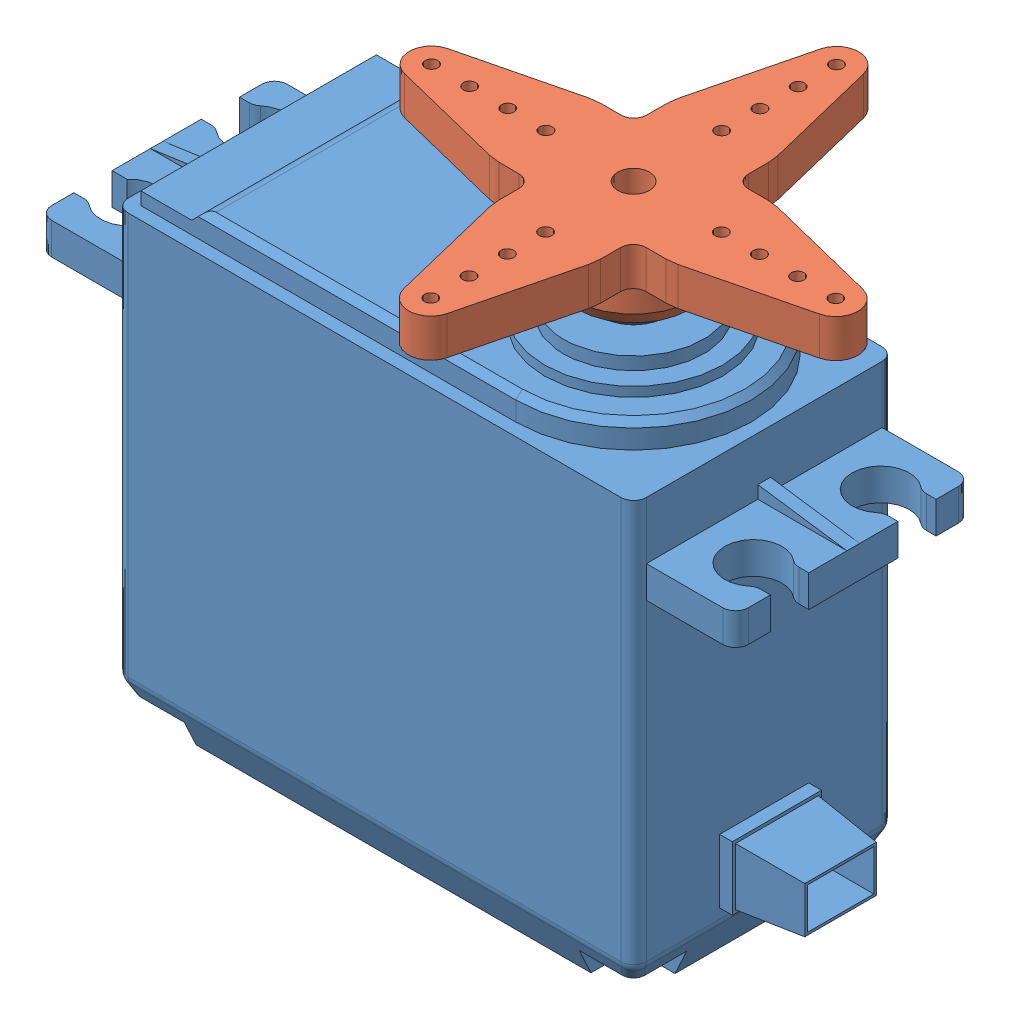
SolidWorks assembly SERVO.SLDASM, configuration Predeterminado (file format 10000). Lengths in mm.
Overall size (55.13 46.75 35.36).
2 component instances, 2 part files, 2 mates.
Components (placement in the parent):
- Cuerpo-1: Cuerpo.SLDPRT [Predeterminado] at (-1.9502 -5.0522 54.7) size (54.7 43.75 20.5)
- Estrella-1: Estrella.SLDPRT [Predeterminado] at (8.1498 24.1978 54.7) x (0.999998 0 0.001855) z (0.001855 0 -0.999998) size (35.3 6.5 35.3)
Mates (geometry in assembly coordinates):
- Concéntrica1: concentric anti-aligned: cylinder of Cuerpo-1 through (8.1498 21.1978 54.7) axis (0 -1 0) radius 3; cylinder of Estrella-1 through (8.1498 17.6978 54.7) axis (0 1 0) radius 3
- Coincidente1: coincident anti-aligned: plane of Cuerpo-1 through (8.1498 21.1978 54.7) normal (0 1 0); plane of Estrella-1 through (8.1498 21.1978 54.7) normal (0 -1 0)
